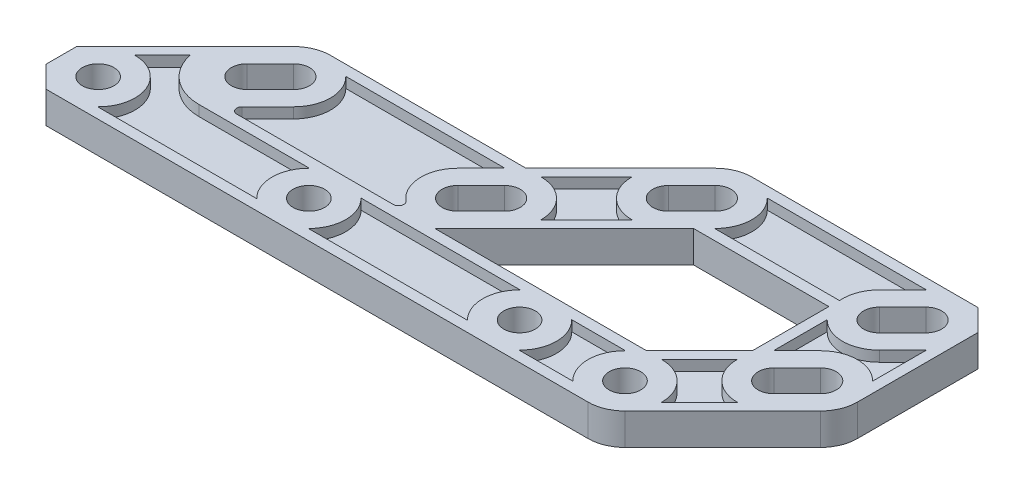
from build123d import *

# Parameters (mm, degrees)
ESQUISSE2_R             = 1.5
BOSS_EXTRU_1_DEPTH      = 1.5
ENL_V_START             = -0.5
ENL_V_MAT_EXTRU_1_DEPTH = 3


with BuildPart() as part:
    # Esquisse2 → Boss.-Extru.1 (new, symmetric)
    with BuildSketch(Plane(origin=(0, 0, 0), x_dir=(1, 0, 0), z_dir=(0, 1, 0))):
        with BuildLine():
            Line((-1.449747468, -3.5), (50, -3.5))
            ThreePointArc((50, -3.5), (51.339392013, -3.233578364), (52.474873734, -2.474873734))
            Line((52.474873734, -2.474873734), (61.753146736, 6.803399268))
            ThreePointArc((61.753146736, 6.803399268), (62.511851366, 7.938880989), (62.778273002, 9.278273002))
            Line((62.778273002, 9.278273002), (62.778273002, 20.72802047))
            Line((62.778273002, 20.72802047), (60.72802047, 22.778273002))
            Line((60.72802047, 22.778273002), (39.278273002, 22.778273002))
            ThreePointArc((39.278273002, 22.778273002), (37.938880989, 22.511851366), (36.803399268, 21.753146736))
            Line((36.803399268, 21.753146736), (27.828525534, 12.778273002))
            Line((27.828525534, 12.778273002), (9.278273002, 12.778273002))
            ThreePointArc((9.278273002, 12.778273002), (7.938880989, 12.511851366), (6.803399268, 11.753146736))
            Line((6.803399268, 11.753146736), (-3.5, 1.449747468))
            Line((-3.5, 1.449747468), (-3.5, -1.449747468))
            Line((-3.5, -1.449747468), (-1.449747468, -3.5))
        make_face()
        with Locations(Location((50, 0, 0), (0, 0, 270))):
            Circle(ESQUISSE2_R, mode=Mode.SUBTRACT)
        with Locations(Location((40, 0, 0), (0, 0, 270))):
            Circle(ESQUISSE2_R, mode=Mode.SUBTRACT)
        with Locations(Location((20, 0, 0), (0, 0, 270))):
            Circle(ESQUISSE2_R, mode=Mode.SUBTRACT)
        with Locations(Location((0, 0, 0), (0, 0, 270))):
            Circle(ESQUISSE2_R, mode=Mode.SUBTRACT)
        with BuildLine():
            Line((58.131727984, 6.01040764), (60.338933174, 8.21761283))
            ThreePointArc((60.338933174, 8.21761283), (60.338933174, 10.338933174), (58.21761283, 10.338933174))
            Line((58.21761283, 10.338933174), (56.01040764, 8.131727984))
            ThreePointArc((56.01040764, 8.131727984), (56.01040764, 6.01040764), (58.131727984, 6.01040764))
        make_face(mode=Mode.SUBTRACT)
        with BuildLine():
            Line((56.01040764, 18.131727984), (58.21761283, 20.338933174))
            ThreePointArc((58.21761283, 20.338933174), (60.338933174, 20.338933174), (60.338933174, 18.21761283))
            Line((60.338933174, 18.21761283), (58.131727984, 16.01040764))
            ThreePointArc((58.131727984, 16.01040764), (56.01040764, 16.01040764), (56.01040764, 18.131727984))
        make_face(mode=Mode.SUBTRACT)
        with BuildLine():
            Line((38.21761283, 20.338933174), (36.01040764, 18.131727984))
            ThreePointArc((36.01040764, 18.131727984), (36.01040764, 16.01040764), (38.131727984, 16.01040764))
            Line((38.131727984, 16.01040764), (40.338933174, 18.21761283))
            ThreePointArc((40.338933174, 18.21761283), (40.338933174, 20.338933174), (38.21761283, 20.338933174))
        make_face(mode=Mode.SUBTRACT)
        with BuildLine():
            Line((26.01040764, 8.131727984), (28.21761283, 10.338933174))
            ThreePointArc((28.21761283, 10.338933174), (30.338933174, 10.338933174), (30.338933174, 8.21761283))
            Line((30.338933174, 8.21761283), (28.131727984, 6.01040764))
            ThreePointArc((28.131727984, 6.01040764), (26.01040764, 6.01040764), (26.01040764, 8.131727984))
        make_face(mode=Mode.SUBTRACT)
        with BuildLine():
            Line((10.338933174, 8.21761283), (8.131727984, 6.01040764))
            ThreePointArc((8.131727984, 6.01040764), (6.01040764, 6.01040764), (6.01040764, 8.131727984))
            Line((6.01040764, 8.131727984), (8.21761283, 10.338933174))
            ThreePointArc((8.21761283, 10.338933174), (10.338933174, 10.338933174), (10.338933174, 8.21761283))
        make_face(mode=Mode.SUBTRACT)
        Polygon((28.449747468, 3.5), (40.72802047, 15.778273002), (53.571067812, 15.778273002), (53.571067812, 8.52081528), (48.550252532, 3.5), align=None, mode=Mode.SUBTRACT)
    extrude(amount=BOSS_EXTRU_1_DEPTH, both=True)

    # Esquisse4 → Enl_v. mat.-Extru.1 (cut)
    with BuildSketch(Plane(origin=(0, 0, 0), x_dir=(1, 0, 0), z_dir=(0, 1, 0)).offset(ENL_V_START)):
        with BuildLine():
            Line((2.449489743, -2.5), (17.550510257, -2.5))
            ThreePointArc((17.550510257, -2.5), (16.5, 0), (17.550510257, 2.5))
            Line((17.550510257, 2.5), (7.071067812, 2.5))
            ThreePointArc((7.071067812, 2.5), (4.189573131, 3.522596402), (2.597320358, 6.132854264))
            Line((2.597320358, 6.132854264), (-0.035716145, 3.499817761))
            ThreePointArc((-0.035716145, 3.499817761), (3.233578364, 1.339392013), (2.449489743, -2.5))
        make_face()
        with BuildLine():
            Line((22.449489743, -2.5), (37.550510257, -2.5))
            ThreePointArc((37.550510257, -2.5), (36.5, 0), (37.550510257, 2.5))
            Line((37.550510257, 2.5), (22.449489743, 2.5))
            ThreePointArc((22.449489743, 2.5), (23.5, 0), (22.449489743, -2.5))
        make_face()
        with BuildLine():
            Line((42.449489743, 2.5), (47.550510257, 2.5))
            ThreePointArc((47.550510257, 2.5), (46.5, 0), (47.550510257, -2.5))
            Line((47.550510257, -2.5), (42.449489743, -2.5))
            ThreePointArc((42.449489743, -2.5), (43.5, 0), (42.449489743, 2.5))
        make_face()
        with BuildLine():
            Line((53.499817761, -0.035716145), (57.106783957, 3.571250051))
            ThreePointArc((57.106783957, 3.571250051), (54.596194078, 4.596194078), (53.571250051, 7.106783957))
            Line((53.571250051, 7.106783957), (50, 3.5))
            ThreePointArc((50, 3.5), (52.487469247, 2.46221379), (53.499817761, -0.035716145))
        make_face()
        with BuildLine():
            Line((54.571067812, 9.52081528), (54.571067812, 14.621578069))
            ThreePointArc((54.571067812, 14.621578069), (57.053209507, 13.571113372), (59.545941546, 14.596194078))
            Line((59.545941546, 14.596194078), (61.778273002, 16.828525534))
            Line((61.778273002, 16.828525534), (61.778273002, 11.727762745))
            ThreePointArc((61.778273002, 11.727762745), (59.296131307, 12.778227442), (56.803399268, 11.753146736))
            Line((56.803399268, 11.753146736), (54.571067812, 9.52081528))
        make_face()
        with BuildLine():
            Line((56.828525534, 21.778273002), (41.727762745, 21.778273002))
            ThreePointArc((41.727762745, 21.778273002), (42.778273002, 19.278273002), (41.727762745, 16.778273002))
            Line((41.727762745, 16.778273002), (53.583336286, 16.778273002))
            ThreePointArc((53.583336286, 16.778273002), (53.784251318, 18.273913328), (54.596194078, 19.545941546))
            Line((54.596194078, 19.545941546), (56.828525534, 21.778273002))
        make_face()
        with BuildLine():
            Line((33.571250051, 17.106783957), (29.242556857, 12.778090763))
            ThreePointArc((29.242556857, 12.778090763), (31.753146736, 11.753146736), (32.778090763, 9.242556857))
            Line((32.778090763, 9.242556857), (37.106783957, 13.571250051))
            ThreePointArc((37.106783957, 13.571250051), (34.596194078, 14.596194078), (33.571250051, 17.106783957))
        make_face()
        with BuildLine():
            Line((26.828525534, 11.778273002), (11.727762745, 11.778273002))
            ThreePointArc((11.727762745, 11.778273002), (12.778227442, 9.296131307), (11.753146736, 6.803399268))
            Line((11.753146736, 6.803399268), (9.303300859, 4.353553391))
            ThreePointArc((9.303300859, 4.353553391), (9.194914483, 3.808658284), (9.656854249, 3.5))
            Line((9.656854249, 3.5), (24.508151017, 3.5))
            ThreePointArc((24.508151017, 3.5), (24.978226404, 3.829620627), (24.828515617, 4.383883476))
            ThreePointArc((24.828515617, 4.383883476), (23.574607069, 6.913707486), (24.596194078, 9.545941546))
            Line((24.596194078, 9.545941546), (26.828525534, 11.778273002))
        make_face()
    enl_v_mat_extru_1 = extrude(amount=-ENL_V_MAT_EXTRU_1_DEPTH, mode=Mode.SUBTRACT)

    # Sym_trie1: Enl_v. mat.-Extru.1 across plane
    add(enl_v_mat_extru_1.mirror(Plane.ZX), mode=Mode.SUBTRACT)


solid = part.part
